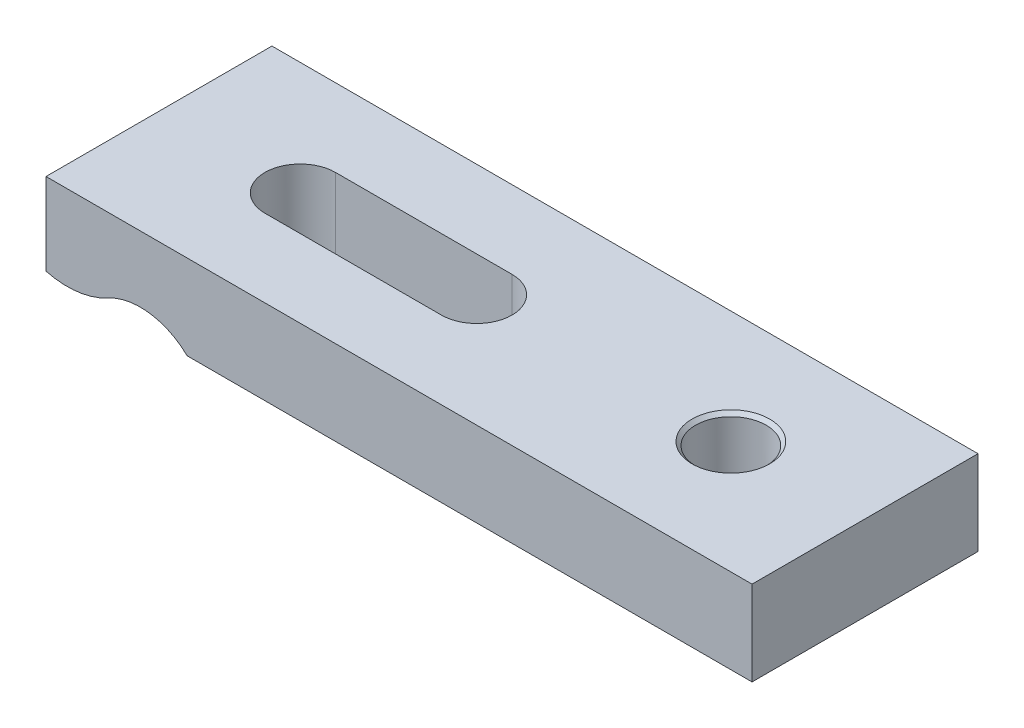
ISO-10303-21;
HEADER;
FILE_DESCRIPTION(('STEP AP214'),'2;1');
FILE_NAME('part.step','',(''),(''),'','','');
FILE_SCHEMA(('AUTOMOTIVE_DESIGN { 1 0 10303 214 1 1 1 1 }'));
ENDSEC;
DATA;
#1=APPLICATION_CONTEXT('core data for automotive mechanical design processes');
#2=APPLICATION_PROTOCOL_DEFINITION('international standard','automotive_design',2000,#1);
#3=PRODUCT_CONTEXT('',#1,'mechanical');
#4=PRODUCT('Part','Part','',(#3));
#5=PRODUCT_RELATED_PRODUCT_CATEGORY('part','',(#4));
#6=PRODUCT_DEFINITION_FORMATION('','',#4);
#7=PRODUCT_DEFINITION_CONTEXT('part definition',#1,'design');
#8=PRODUCT_DEFINITION('design','',#6,#7);
#9=PRODUCT_DEFINITION_SHAPE('','',#8);
#10=(LENGTH_UNIT() NAMED_UNIT(*) SI_UNIT(.MILLI.,.METRE.));
#11=(NAMED_UNIT(*) PLANE_ANGLE_UNIT() SI_UNIT($,.RADIAN.));
#12=(NAMED_UNIT(*) SI_UNIT($,.STERADIAN.) SOLID_ANGLE_UNIT());
#13=UNCERTAINTY_MEASURE_WITH_UNIT(LENGTH_MEASURE(1.E-05),#10,'distance_accuracy_value','');
#14=(GEOMETRIC_REPRESENTATION_CONTEXT(3) GLOBAL_UNCERTAINTY_ASSIGNED_CONTEXT((#13)) GLOBAL_UNIT_ASSIGNED_CONTEXT((#10,
#11,#12)) REPRESENTATION_CONTEXT('',''));
#15=CARTESIAN_POINT('',(0.,0.,0.));
#16=DIRECTION('',(0.,0.,1.));
#17=DIRECTION('',(1.,0.,0.));
#18=AXIS2_PLACEMENT_3D('',#15,#16,#17);
#19=CARTESIAN_POINT('',(0.,0.,32.));
#20=DIRECTION('',(1.,0.,0.));
#21=DIRECTION('',(0.,1.,0.));
#22=AXIS2_PLACEMENT_3D('',#19,#20,#21);
#23=PLANE('',#22);
#24=DIRECTION('',(0.,-1.,0.));
#25=VECTOR('',#24,1.);
#26=CARTESIAN_POINT('',(0.,0.,0.));
#27=LINE('',#26,#25);
#28=CARTESIAN_POINT('',(0.,0.,0.));
#29=VERTEX_POINT('',#28);
#30=CARTESIAN_POINT('',(0.,-11.6189500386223,0.));
#31=VERTEX_POINT('',#30);
#32=EDGE_CURVE('E161',#29,#31,#27,.T.);
#33=ORIENTED_EDGE('',*,*,#32,.T.);
#34=DIRECTION('',(0.,0.,-1.));
#35=VECTOR('',#34,1.);
#36=CARTESIAN_POINT('',(0.,-11.6189500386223,32.));
#37=LINE('',#36,#35);
#38=CARTESIAN_POINT('',(0.,-11.6189500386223,32.));
#39=VERTEX_POINT('',#38);
#40=EDGE_CURVE('E224',#39,#31,#37,.T.);
#41=ORIENTED_EDGE('',*,*,#40,.F.);
#42=DIRECTION('',(0.,-1.,0.));
#43=VECTOR('',#42,1.);
#44=CARTESIAN_POINT('',(0.,0.,32.));
#45=LINE('',#44,#43);
#46=CARTESIAN_POINT('',(0.,0.,32.));
#47=VERTEX_POINT('',#46);
#48=EDGE_CURVE('E162',#47,#39,#45,.T.);
#49=ORIENTED_EDGE('',*,*,#48,.F.);
#50=DIRECTION('',(0.,0.,-1.));
#51=VECTOR('',#50,1.);
#52=CARTESIAN_POINT('',(0.,0.,32.));
#53=LINE('',#52,#51);
#54=EDGE_CURVE('E240',#47,#29,#53,.T.);
#55=ORIENTED_EDGE('',*,*,#54,.T.);
#56=EDGE_LOOP('',(#33,#41,#49,#55));
#57=FACE_BOUND('',#56,.T.);
#58=ADVANCED_FACE('F30',(#57),#23,.F.);
#59=CARTESIAN_POINT('',(3.,0.,32.));
#60=DIRECTION('',(0.,0.,-1.));
#61=DIRECTION('',(-1.,0.,0.));
#62=AXIS2_PLACEMENT_3D('',#59,#60,#61);
#63=CYLINDRICAL_SURFACE('',#62,12.);
#64=CARTESIAN_POINT('',(3.,0.,0.));
#65=DIRECTION('',(0.,0.,1.));
#66=DIRECTION('',(1.,0.,0.));
#67=AXIS2_PLACEMENT_3D('',#64,#65,#66);
#68=CIRCLE('',#67,12.);
#69=CARTESIAN_POINT('',(8.7617013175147,-10.5262907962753,0.));
#70=VERTEX_POINT('',#69);
#71=EDGE_CURVE('E253',#31,#70,#68,.T.);
#72=ORIENTED_EDGE('',*,*,#71,.T.);
#73=DIRECTION('',(0.,0.,-1.));
#74=VECTOR('',#73,1.);
#75=CARTESIAN_POINT('',(8.7617013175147,-10.5262907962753,32.));
#76=LINE('',#75,#74);
#77=CARTESIAN_POINT('',(8.7617013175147,-10.5262907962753,32.));
#78=VERTEX_POINT('',#77);
#79=EDGE_CURVE('E229',#78,#70,#76,.T.);
#80=ORIENTED_EDGE('',*,*,#79,.F.);
#81=CARTESIAN_POINT('',(3.,0.,32.));
#82=DIRECTION('',(0.,0.,1.));
#83=DIRECTION('',(1.,0.,0.));
#84=AXIS2_PLACEMENT_3D('',#81,#82,#83);
#85=CIRCLE('',#84,12.);
#86=EDGE_CURVE('E262',#39,#78,#85,.T.);
#87=ORIENTED_EDGE('',*,*,#86,.F.);
#88=ORIENTED_EDGE('',*,*,#40,.T.);
#89=EDGE_LOOP('',(#72,#80,#87,#88));
#90=FACE_BOUND('',#89,.T.);
#91=ADVANCED_FACE('F194',(#90),#63,.T.);
#92=CARTESIAN_POINT('',(13.3710623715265,-18.9473234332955,32.));
#93=DIRECTION('',(0.,0.,-1.));
#94=DIRECTION('',(-1.,0.,0.));
#95=AXIS2_PLACEMENT_3D('',#92,#93,#94);
#96=CYLINDRICAL_SURFACE('',#95,9.6);
#97=DIRECTION('',(0.,0.,-1.));
#98=VECTOR('',#97,1.);
#99=CARTESIAN_POINT('',(19.9963696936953,-12.,32.));
#100=LINE('',#99,#98);
#101=CARTESIAN_POINT('',(19.9963696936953,-12.,11.0000013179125));
#102=VERTEX_POINT('',#101);
#103=CARTESIAN_POINT('',(19.9963696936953,-12.,0.));
#104=VERTEX_POINT('',#103);
#105=EDGE_CURVE('E233',#102,#104,#100,.T.);
#106=ORIENTED_EDGE('',*,*,#105,.F.);
#107=CARTESIAN_POINT('',(19.9963696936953,-12.,11.0000013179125));
#108=CARTESIAN_POINT('',(19.8813083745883,-11.8902365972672,11.0000797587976));
#109=CARTESIAN_POINT('',(19.7634393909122,-11.7833250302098,11.004143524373));
#110=CARTESIAN_POINT('',(19.5228037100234,-11.5756727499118,11.0213614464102));
#111=CARTESIAN_POINT('',(19.4000316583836,-11.4749391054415,11.0345258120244));
#112=CARTESIAN_POINT('',(19.1497850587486,-11.2797470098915,11.0711844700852));
#113=CARTESIAN_POINT('',(19.0222857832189,-11.1853320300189,11.0947432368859));
#114=CARTESIAN_POINT('',(18.7645717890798,-11.0040966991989,11.1532313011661));
#115=CARTESIAN_POINT('',(18.634358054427,-10.9172736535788,11.1881565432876));
#116=CARTESIAN_POINT('',(18.3716238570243,-10.7510600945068,11.2705722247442));
#117=CARTESIAN_POINT('',(18.2390933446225,-10.6717322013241,11.3181576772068));
#118=CARTESIAN_POINT('',(17.9744699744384,-10.5216616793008,11.4264170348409));
#119=CARTESIAN_POINT('',(17.8423771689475,-10.4509200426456,11.487092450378));
#120=CARTESIAN_POINT('',(17.5811148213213,-10.318486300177,11.6215873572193));
#121=CARTESIAN_POINT('',(17.4519360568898,-10.2567607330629,11.6953558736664));
#122=CARTESIAN_POINT('',(17.1980466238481,-10.1420071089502,11.856134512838));
#123=CARTESIAN_POINT('',(17.0733351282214,-10.0889774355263,11.9431421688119));
#124=CARTESIAN_POINT('',(16.8480314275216,-9.99840007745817,12.1164104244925));
#125=CARTESIAN_POINT('',(16.7465640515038,-9.95972245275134,12.2009498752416));
#126=CARTESIAN_POINT('',(16.5495654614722,-9.88817895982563,12.3789341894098));
#127=CARTESIAN_POINT('',(16.4540339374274,-9.8553127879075,12.4723785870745));
#128=CARTESIAN_POINT('',(16.2699197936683,-9.7949452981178,12.6676541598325));
#129=CARTESIAN_POINT('',(16.1813437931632,-9.76744905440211,12.7694931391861));
#130=CARTESIAN_POINT('',(16.0122104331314,-9.7173657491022,12.9807545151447));
#131=CARTESIAN_POINT('',(15.931653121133,-9.69477871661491,13.0901769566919));
#132=CARTESIAN_POINT('',(15.7825603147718,-9.6548325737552,13.3110934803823));
#133=CARTESIAN_POINT('',(15.7136643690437,-9.63729522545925,13.4223125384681));
#134=CARTESIAN_POINT('',(15.5846008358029,-9.60576768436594,13.6502325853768));
#135=CARTESIAN_POINT('',(15.5244361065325,-9.59177865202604,13.7669353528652));
#136=CARTESIAN_POINT('',(15.4134043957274,-9.56691429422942,14.0049131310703));
#137=CARTESIAN_POINT('',(15.362531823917,-9.55603709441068,14.126185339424));
#138=CARTESIAN_POINT('',(15.2704280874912,-9.53697681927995,14.3725920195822));
#139=CARTESIAN_POINT('',(15.2292005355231,-9.52879475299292,14.497727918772));
#140=CARTESIAN_POINT('',(15.1556918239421,-9.51458570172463,14.7545968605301));
#141=CARTESIAN_POINT('',(15.123699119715,-9.50862678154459,14.8864162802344));
#142=CARTESIAN_POINT('',(15.0705103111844,-9.49890513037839,15.1523414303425));
#143=CARTESIAN_POINT('',(15.0493180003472,-9.49514317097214,15.2864479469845));
#144=CARTESIAN_POINT('',(15.0179061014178,-9.48961965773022,15.5559843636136));
#145=CARTESIAN_POINT('',(15.007686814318,-9.48785815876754,15.6914142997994));
#146=CARTESIAN_POINT('',(14.9982979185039,-9.48623855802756,15.9626683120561));
#147=CARTESIAN_POINT('',(14.9991284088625,-9.4863804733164,16.0984923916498));
#148=CARTESIAN_POINT('',(15.011953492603,-9.48859622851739,16.3721685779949));
#149=CARTESIAN_POINT('',(15.024158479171,-9.49070647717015,16.5100105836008));
#150=CARTESIAN_POINT('',(15.0599331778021,-9.49703008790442,16.7841152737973));
#151=CARTESIAN_POINT('',(15.0834990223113,-9.50124273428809,16.9203784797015));
#152=CARTESIAN_POINT('',(15.1418193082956,-9.51200157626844,17.1904503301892));
#153=CARTESIAN_POINT('',(15.1765779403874,-9.51854864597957,17.3242580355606));
#154=CARTESIAN_POINT('',(15.2569836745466,-9.53430176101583,17.5883450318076));
#155=CARTESIAN_POINT('',(15.3026265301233,-9.54350676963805,17.7186256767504));
#156=CARTESIAN_POINT('',(15.4043334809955,-9.56497281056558,17.9745312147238));
#157=CARTESIAN_POINT('',(15.4603792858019,-9.57722849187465,18.1001638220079));
#158=CARTESIAN_POINT('',(15.5824229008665,-9.60527863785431,18.346026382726));
#159=CARTESIAN_POINT('',(15.6484167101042,-9.62107168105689,18.4662584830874));
#160=CARTESIAN_POINT('',(15.7897621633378,-9.65672594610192,18.700483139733));
#161=CARTESIAN_POINT('',(15.8651151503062,-9.67658775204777,18.8144747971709));
#162=CARTESIAN_POINT('',(16.0244150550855,-9.72091833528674,19.0353354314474));
#163=CARTESIAN_POINT('',(16.1083617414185,-9.74538698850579,19.1422046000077));
#164=CARTESIAN_POINT('',(16.2818469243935,-9.79880612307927,19.3455597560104));
#165=CARTESIAN_POINT('',(16.3712030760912,-9.82763507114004,19.442233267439));
#166=CARTESIAN_POINT('',(16.5562901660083,-9.89062005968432,19.6273953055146));
#167=CARTESIAN_POINT('',(16.6520209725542,-9.92477599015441,19.7158840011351));
#168=CARTESIAN_POINT('',(16.848699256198,-9.99874439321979,19.8840740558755));
#169=CARTESIAN_POINT('',(16.9496418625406,-10.0385516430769,19.9637834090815));
#170=CARTESIAN_POINT('',(17.1556744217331,-10.1241068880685,20.1141311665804));
#171=CARTESIAN_POINT('',(17.2607643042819,-10.1698547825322,20.1847697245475));
#172=CARTESIAN_POINT('',(17.4714399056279,-10.2663088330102,20.3152500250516));
#173=CARTESIAN_POINT('',(17.5769584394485,-10.3168764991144,20.3753029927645));
#174=CARTESIAN_POINT('',(17.7897433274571,-10.4238591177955,20.4865561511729));
#175=CARTESIAN_POINT('',(17.8970103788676,-10.4802764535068,20.5377527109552));
#176=CARTESIAN_POINT('',(18.1123937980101,-10.5989747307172,20.6314972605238));
#177=CARTESIAN_POINT('',(18.220511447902,-10.6612673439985,20.6740274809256));
#178=CARTESIAN_POINT('',(18.436343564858,-10.791417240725,20.7505882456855));
#179=CARTESIAN_POINT('',(18.5440581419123,-10.8592728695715,20.784621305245));
#180=CARTESIAN_POINT('',(18.7689641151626,-11.0073894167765,20.8476304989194));
#181=CARTESIAN_POINT('',(18.8860231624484,-11.088212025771,20.8757577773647));
#182=CARTESIAN_POINT('',(19.1176270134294,-11.2559350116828,20.9229455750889));
#183=CARTESIAN_POINT('',(19.2321709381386,-11.3428374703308,20.9420029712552));
#184=CARTESIAN_POINT('',(19.4574019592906,-11.5218897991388,20.9717642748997));
#185=CARTESIAN_POINT('',(19.5681029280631,-11.6140167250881,20.982502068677));
#186=CARTESIAN_POINT('',(19.7854219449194,-11.8033173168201,20.9965795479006));
#187=CARTESIAN_POINT('',(19.8920436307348,-11.900486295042,20.9999259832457));
#188=CARTESIAN_POINT('',(19.9963696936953,-12.,20.9999986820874));
#189=B_SPLINE_CURVE_WITH_KNOTS('',3,(#107,#108,#109,#110,#111,#112,#113,#114,#115,#116,#117,
#118,#119,#120,#121,#122,#123,#124,#125,#126,#127,#128,#129,#130,#131,#132,#133,#134,#135,#136,
#137,#138,#139,#140,#141,#142,#143,#144,#145,#146,#147,#148,#149,#150,#151,#152,#153,#154,#155,
#156,#157,#158,#159,#160,#161,#162,#163,#164,#165,#166,#167,#168,#169,#170,#171,#172,#173,#174,
#175,#176,#177,#178,#179,#180,#181,#182,#183,#184,#185,#186,#187,#188),.UNSPECIFIED.,.F.,.F.,(4,
2,2,2,2,2,2,2,2,2,2,2,2,2,2,2,2,2,2,2,2,2,2,2,2,2,2,2,2,2,2,2,2,2,2,2,2,2,2,2,4),(0.,
0.477056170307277,0.954648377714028,1.43524557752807,1.91567149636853,2.39980995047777,
2.88400429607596,3.36635332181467,3.84861258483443,4.26094157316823,4.67324900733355,
5.08594417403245,5.49864178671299,5.89419032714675,6.28986806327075,6.68530696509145,
7.08089374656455,7.48775461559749,7.8947582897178,8.30177312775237,8.70879161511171,
9.12349135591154,9.5380500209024,9.95276407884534,10.3673165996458,10.7811470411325,
11.1948114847,11.6085353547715,12.0222480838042,12.4260408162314,12.8298252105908,
13.23323884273,13.6366456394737,14.0307598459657,14.4250352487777,14.8201111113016,
15.2150698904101,15.6496187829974,16.0843171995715,16.5172356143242,16.9497585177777),.UNSPECIFIED.);
#190=CARTESIAN_POINT('',(19.9963696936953,-12.,20.9999986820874));
#191=VERTEX_POINT('',#190);
#192=EDGE_CURVE('E151',#102,#191,#189,.T.);
#193=ORIENTED_EDGE('',*,*,#192,.T.);
#194=CARTESIAN_POINT('',(19.9963696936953,-12.,32.));
#195=VERTEX_POINT('',#194);
#196=EDGE_CURVE('E134',#195,#191,#100,.T.);
#197=ORIENTED_EDGE('',*,*,#196,.F.);
#198=CARTESIAN_POINT('',(13.3710623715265,-18.9473234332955,32.));
#199=DIRECTION('',(0.,0.,-1.));
#200=DIRECTION('',(-1.,0.,0.));
#201=AXIS2_PLACEMENT_3D('',#198,#199,#200);
#202=CIRCLE('',#201,9.6);
#203=EDGE_CURVE('E261',#78,#195,#202,.T.);
#204=ORIENTED_EDGE('',*,*,#203,.F.);
#205=ORIENTED_EDGE('',*,*,#79,.T.);
#206=CARTESIAN_POINT('',(13.3710623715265,-18.9473234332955,0.));
#207=DIRECTION('',(0.,0.,-1.));
#208=DIRECTION('',(-1.,0.,0.));
#209=AXIS2_PLACEMENT_3D('',#206,#207,#208);
#210=CIRCLE('',#209,9.6);
#211=EDGE_CURVE('E250',#70,#104,#210,.T.);
#212=ORIENTED_EDGE('',*,*,#211,.T.);
#213=EDGE_LOOP('',(#106,#193,#197,#204,#205,#212));
#214=FACE_BOUND('',#213,.T.);
#215=ADVANCED_FACE('F164',(#214),#96,.F.);
#216=CARTESIAN_POINT('',(19.9963696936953,-12.,32.));
#217=DIRECTION('',(0.,1.,0.));
#218=DIRECTION('',(0.,0.,1.));
#219=AXIS2_PLACEMENT_3D('',#216,#217,#218);
#220=PLANE('',#219);
#221=CARTESIAN_POINT('',(81.,-12.,16.));
#222=DIRECTION('',(0.,1.,0.));
#223=DIRECTION('',(0.,0.,1.));
#224=AXIS2_PLACEMENT_3D('',#221,#222,#223);
#225=CIRCLE('',#224,5.50000000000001);
#226=CARTESIAN_POINT('',(81.,-12.,21.5));
#227=VERTEX_POINT('',#226);
#228=EDGE_CURVE('E11',#227,#227,#225,.T.);
#229=ORIENTED_EDGE('',*,*,#228,.T.);
#230=EDGE_LOOP('',(#229));
#231=FACE_BOUND('',#230,.T.);
#232=DIRECTION('',(-1.,0.,0.));
#233=VECTOR('',#232,1.);
#234=CARTESIAN_POINT('',(20.,-12.,11.));
#235=LINE('',#234,#233);
#236=CARTESIAN_POINT('',(45.,-12.,11.));
#237=VERTEX_POINT('',#236);
#238=CARTESIAN_POINT('',(20.,-12.,11.));
#239=VERTEX_POINT('',#238);
#240=EDGE_CURVE('E121',#237,#239,#235,.T.);
#241=ORIENTED_EDGE('',*,*,#240,.T.);
#242=CARTESIAN_POINT('',(20.,-12.,16.));
#243=DIRECTION('',(0.,1.,0.));
#244=DIRECTION('',(0.,0.,1.));
#245=AXIS2_PLACEMENT_3D('',#242,#243,#244);
#246=CIRCLE('',#245,5.);
#247=EDGE_CURVE('E127',#239,#102,#246,.T.);
#248=ORIENTED_EDGE('',*,*,#247,.T.);
#249=ORIENTED_EDGE('',*,*,#105,.T.);
#250=DIRECTION('',(1.,0.,0.));
#251=VECTOR('',#250,1.);
#252=CARTESIAN_POINT('',(19.9963696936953,-12.,0.));
#253=LINE('',#252,#251);
#254=CARTESIAN_POINT('',(100.,-12.,0.));
#255=VERTEX_POINT('',#254);
#256=EDGE_CURVE('E248',#104,#255,#253,.T.);
#257=ORIENTED_EDGE('',*,*,#256,.T.);
#258=DIRECTION('',(0.,0.,-1.));
#259=VECTOR('',#258,1.);
#260=CARTESIAN_POINT('',(100.,-12.,32.));
#261=LINE('',#260,#259);
#262=CARTESIAN_POINT('',(100.,-12.,32.));
#263=VERTEX_POINT('',#262);
#264=EDGE_CURVE('E234',#263,#255,#261,.T.);
#265=ORIENTED_EDGE('',*,*,#264,.F.);
#266=DIRECTION('',(1.,0.,0.));
#267=VECTOR('',#266,1.);
#268=CARTESIAN_POINT('',(19.9963696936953,-12.,32.));
#269=LINE('',#268,#267);
#270=EDGE_CURVE('E259',#195,#263,#269,.T.);
#271=ORIENTED_EDGE('',*,*,#270,.F.);
#272=ORIENTED_EDGE('',*,*,#196,.T.);
#273=CARTESIAN_POINT('',(20.,-12.,21.));
#274=VERTEX_POINT('',#273);
#275=EDGE_CURVE('E115',#191,#274,#246,.T.);
#276=ORIENTED_EDGE('',*,*,#275,.T.);
#277=DIRECTION('',(1.,0.,0.));
#278=VECTOR('',#277,1.);
#279=CARTESIAN_POINT('',(20.,-12.,21.));
#280=LINE('',#279,#278);
#281=CARTESIAN_POINT('',(45.,-12.,21.));
#282=VERTEX_POINT('',#281);
#283=EDGE_CURVE('E124',#274,#282,#280,.T.);
#284=ORIENTED_EDGE('',*,*,#283,.T.);
#285=CARTESIAN_POINT('',(45.,-12.,16.));
#286=DIRECTION('',(0.,1.,0.));
#287=DIRECTION('',(0.,0.,1.));
#288=AXIS2_PLACEMENT_3D('',#285,#286,#287);
#289=CIRCLE('',#288,5.);
#290=EDGE_CURVE('E45',#282,#237,#289,.T.);
#291=ORIENTED_EDGE('',*,*,#290,.T.);
#292=EDGE_LOOP('',(#241,#248,#249,#257,#265,#271,#272,#276,#284,#291));
#293=FACE_BOUND('',#292,.T.);
#294=ADVANCED_FACE('F131',(#231,#293),#220,.F.);
#295=CARTESIAN_POINT('',(100.,0.,32.));
#296=DIRECTION('',(-1.,0.,0.));
#297=DIRECTION('',(0.,0.,1.));
#298=AXIS2_PLACEMENT_3D('',#295,#296,#297);
#299=PLANE('',#298);
#300=DIRECTION('',(0.,1.,0.));
#301=VECTOR('',#300,1.);
#302=CARTESIAN_POINT('',(100.,0.,0.));
#303=LINE('',#302,#301);
#304=CARTESIAN_POINT('',(100.,0.,0.));
#305=VERTEX_POINT('',#304);
#306=EDGE_CURVE('E246',#255,#305,#303,.T.);
#307=ORIENTED_EDGE('',*,*,#306,.T.);
#308=DIRECTION('',(0.,0.,-1.));
#309=VECTOR('',#308,1.);
#310=CARTESIAN_POINT('',(100.,0.,32.));
#311=LINE('',#310,#309);
#312=CARTESIAN_POINT('',(100.,0.,32.));
#313=VERTEX_POINT('',#312);
#314=EDGE_CURVE('E237',#313,#305,#311,.T.);
#315=ORIENTED_EDGE('',*,*,#314,.F.);
#316=DIRECTION('',(0.,1.,0.));
#317=VECTOR('',#316,1.);
#318=CARTESIAN_POINT('',(100.,0.,32.));
#319=LINE('',#318,#317);
#320=EDGE_CURVE('E257',#263,#313,#319,.T.);
#321=ORIENTED_EDGE('',*,*,#320,.F.);
#322=ORIENTED_EDGE('',*,*,#264,.T.);
#323=EDGE_LOOP('',(#307,#315,#321,#322));
#324=FACE_BOUND('',#323,.T.);
#325=ADVANCED_FACE('F185',(#324),#299,.F.);
#326=CARTESIAN_POINT('',(0.,0.,32.));
#327=DIRECTION('',(0.,-1.,0.));
#328=DIRECTION('',(0.,0.,-1.));
#329=AXIS2_PLACEMENT_3D('',#326,#327,#328);
#330=PLANE('',#329);
#331=CARTESIAN_POINT('',(81.,0.,16.));
#332=DIRECTION('',(0.,-1.,0.));
#333=DIRECTION('',(0.,0.,-1.));
#334=AXIS2_PLACEMENT_3D('',#331,#332,#333);
#335=CIRCLE('',#334,5.50000000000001);
#336=CARTESIAN_POINT('',(81.,0.,10.5));
#337=VERTEX_POINT('',#336);
#338=EDGE_CURVE('E38',#337,#337,#335,.T.);
#339=ORIENTED_EDGE('',*,*,#338,.T.);
#340=EDGE_LOOP('',(#339));
#341=FACE_BOUND('',#340,.T.);
#342=DIRECTION('',(1.,0.,0.));
#343=VECTOR('',#342,1.);
#344=CARTESIAN_POINT('',(20.,0.,21.));
#345=LINE('',#344,#343);
#346=CARTESIAN_POINT('',(20.,0.,21.));
#347=VERTEX_POINT('',#346);
#348=CARTESIAN_POINT('',(45.,0.,21.));
#349=VERTEX_POINT('',#348);
#350=EDGE_CURVE('E145',#347,#349,#345,.T.);
#351=ORIENTED_EDGE('',*,*,#350,.F.);
#352=CARTESIAN_POINT('',(20.,0.,16.));
#353=DIRECTION('',(0.,1.,0.));
#354=DIRECTION('',(0.,0.,1.));
#355=AXIS2_PLACEMENT_3D('',#352,#353,#354);
#356=CIRCLE('',#355,5.);
#357=CARTESIAN_POINT('',(20.,0.,11.));
#358=VERTEX_POINT('',#357);
#359=EDGE_CURVE('E53',#358,#347,#356,.T.);
#360=ORIENTED_EDGE('',*,*,#359,.F.);
#361=DIRECTION('',(-1.,0.,0.));
#362=VECTOR('',#361,1.);
#363=CARTESIAN_POINT('',(20.,0.,11.));
#364=LINE('',#363,#362);
#365=CARTESIAN_POINT('',(45.,0.,11.));
#366=VERTEX_POINT('',#365);
#367=EDGE_CURVE('E135',#366,#358,#364,.T.);
#368=ORIENTED_EDGE('',*,*,#367,.F.);
#369=CARTESIAN_POINT('',(45.,0.,16.));
#370=DIRECTION('',(0.,1.,0.));
#371=DIRECTION('',(0.,0.,1.));
#372=AXIS2_PLACEMENT_3D('',#369,#370,#371);
#373=CIRCLE('',#372,5.);
#374=EDGE_CURVE('E139',#349,#366,#373,.T.);
#375=ORIENTED_EDGE('',*,*,#374,.F.);
#376=EDGE_LOOP('',(#351,#360,#368,#375));
#377=FACE_BOUND('',#376,.T.);
#378=DIRECTION('',(-1.,0.,0.));
#379=VECTOR('',#378,1.);
#380=CARTESIAN_POINT('',(0.,0.,0.));
#381=LINE('',#380,#379);
#382=EDGE_CURVE('E244',#305,#29,#381,.T.);
#383=ORIENTED_EDGE('',*,*,#382,.T.);
#384=ORIENTED_EDGE('',*,*,#54,.F.);
#385=DIRECTION('',(-1.,0.,0.));
#386=VECTOR('',#385,1.);
#387=CARTESIAN_POINT('',(0.,0.,32.));
#388=LINE('',#387,#386);
#389=EDGE_CURVE('E243',#313,#47,#388,.T.);
#390=ORIENTED_EDGE('',*,*,#389,.F.);
#391=ORIENTED_EDGE('',*,*,#314,.T.);
#392=EDGE_LOOP('',(#383,#384,#390,#391));
#393=FACE_BOUND('',#392,.T.);
#394=ADVANCED_FACE('F178',(#341,#377,#393),#330,.F.);
#395=CARTESIAN_POINT('',(3.,0.,32.));
#396=DIRECTION('',(0.,0.,1.));
#397=DIRECTION('',(1.,0.,0.));
#398=AXIS2_PLACEMENT_3D('',#395,#396,#397);
#399=PLANE('',#398);
#400=ORIENTED_EDGE('',*,*,#48,.T.);
#401=ORIENTED_EDGE('',*,*,#86,.T.);
#402=ORIENTED_EDGE('',*,*,#203,.T.);
#403=ORIENTED_EDGE('',*,*,#270,.T.);
#404=ORIENTED_EDGE('',*,*,#320,.T.);
#405=ORIENTED_EDGE('',*,*,#389,.T.);
#406=EDGE_LOOP('',(#400,#401,#402,#403,#404,#405));
#407=FACE_BOUND('',#406,.T.);
#408=ADVANCED_FACE('F175',(#407),#399,.T.);
#409=CARTESIAN_POINT('',(3.,0.,0.));
#410=DIRECTION('',(0.,0.,1.));
#411=DIRECTION('',(1.,0.,0.));
#412=AXIS2_PLACEMENT_3D('',#409,#410,#411);
#413=PLANE('',#412);
#414=ORIENTED_EDGE('',*,*,#32,.F.);
#415=ORIENTED_EDGE('',*,*,#382,.F.);
#416=ORIENTED_EDGE('',*,*,#306,.F.);
#417=ORIENTED_EDGE('',*,*,#256,.F.);
#418=ORIENTED_EDGE('',*,*,#211,.F.);
#419=ORIENTED_EDGE('',*,*,#71,.F.);
#420=EDGE_LOOP('',(#414,#415,#416,#417,#418,#419));
#421=FACE_BOUND('',#420,.T.);
#422=ADVANCED_FACE('F173',(#421),#413,.F.);
#423=CARTESIAN_POINT('',(20.,-12.,16.));
#424=DIRECTION('',(0.,1.,0.));
#425=DIRECTION('',(0.,0.,1.));
#426=AXIS2_PLACEMENT_3D('',#423,#424,#425);
#427=CYLINDRICAL_SURFACE('',#426,5.);
#428=ORIENTED_EDGE('',*,*,#247,.F.);
#429=DIRECTION('',(0.,1.,0.));
#430=VECTOR('',#429,1.);
#431=CARTESIAN_POINT('',(20.,-12.,11.));
#432=LINE('',#431,#430);
#433=EDGE_CURVE('E149',#239,#358,#432,.T.);
#434=ORIENTED_EDGE('',*,*,#433,.T.);
#435=ORIENTED_EDGE('',*,*,#359,.T.);
#436=DIRECTION('',(0.,1.,0.));
#437=VECTOR('',#436,1.);
#438=CARTESIAN_POINT('',(20.,-12.,21.));
#439=LINE('',#438,#437);
#440=EDGE_CURVE('E110',#274,#347,#439,.T.);
#441=ORIENTED_EDGE('',*,*,#440,.F.);
#442=ORIENTED_EDGE('',*,*,#275,.F.);
#443=ORIENTED_EDGE('',*,*,#192,.F.);
#444=EDGE_LOOP('',(#428,#434,#435,#441,#442,#443));
#445=FACE_BOUND('',#444,.T.);
#446=ADVANCED_FACE('F113',(#445),#427,.F.);
#447=CARTESIAN_POINT('',(20.,-12.,11.));
#448=DIRECTION('',(0.,0.,-1.));
#449=DIRECTION('',(-1.,0.,0.));
#450=AXIS2_PLACEMENT_3D('',#447,#448,#449);
#451=PLANE('',#450);
#452=ORIENTED_EDGE('',*,*,#367,.T.);
#453=ORIENTED_EDGE('',*,*,#433,.F.);
#454=ORIENTED_EDGE('',*,*,#240,.F.);
#455=DIRECTION('',(0.,1.,0.));
#456=VECTOR('',#455,1.);
#457=CARTESIAN_POINT('',(45.,-12.,11.));
#458=LINE('',#457,#456);
#459=EDGE_CURVE('E152',#237,#366,#458,.T.);
#460=ORIENTED_EDGE('',*,*,#459,.T.);
#461=EDGE_LOOP('',(#452,#453,#454,#460));
#462=FACE_BOUND('',#461,.T.);
#463=ADVANCED_FACE('F172',(#462),#451,.F.);
#464=CARTESIAN_POINT('',(45.,-12.,16.));
#465=DIRECTION('',(0.,1.,0.));
#466=DIRECTION('',(0.,0.,1.));
#467=AXIS2_PLACEMENT_3D('',#464,#465,#466);
#468=CYLINDRICAL_SURFACE('',#467,5.);
#469=ORIENTED_EDGE('',*,*,#374,.T.);
#470=ORIENTED_EDGE('',*,*,#459,.F.);
#471=ORIENTED_EDGE('',*,*,#290,.F.);
#472=DIRECTION('',(0.,1.,0.));
#473=VECTOR('',#472,1.);
#474=CARTESIAN_POINT('',(45.,-12.,21.));
#475=LINE('',#474,#473);
#476=EDGE_CURVE('E120',#282,#349,#475,.T.);
#477=ORIENTED_EDGE('',*,*,#476,.T.);
#478=EDGE_LOOP('',(#469,#470,#471,#477));
#479=FACE_BOUND('',#478,.T.);
#480=ADVANCED_FACE('F285',(#479),#468,.F.);
#481=CARTESIAN_POINT('',(20.,-12.,21.));
#482=DIRECTION('',(0.,0.,1.));
#483=DIRECTION('',(1.,0.,0.));
#484=AXIS2_PLACEMENT_3D('',#481,#482,#483);
#485=PLANE('',#484);
#486=ORIENTED_EDGE('',*,*,#350,.T.);
#487=ORIENTED_EDGE('',*,*,#476,.F.);
#488=ORIENTED_EDGE('',*,*,#283,.F.);
#489=ORIENTED_EDGE('',*,*,#440,.T.);
#490=EDGE_LOOP('',(#486,#487,#488,#489));
#491=FACE_BOUND('',#490,.T.);
#492=ADVANCED_FACE('F125',(#491),#485,.F.);
#493=CARTESIAN_POINT('',(81.,-12.,16.));
#494=DIRECTION('',(0.,1.,0.));
#495=DIRECTION('',(0.,0.,1.));
#496=AXIS2_PLACEMENT_3D('',#493,#494,#495);
#497=CYLINDRICAL_SURFACE('',#496,5.);
#498=CARTESIAN_POINT('',(81.,-0.500000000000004,16.));
#499=DIRECTION('',(0.,-1.,0.));
#500=DIRECTION('',(0.,0.,-1.));
#501=AXIS2_PLACEMENT_3D('',#498,#499,#500);
#502=CIRCLE('',#501,5.);
#503=CARTESIAN_POINT('',(81.,-0.500000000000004,11.));
#504=VERTEX_POINT('',#503);
#505=EDGE_CURVE('E220',#504,#504,#502,.F.);
#506=ORIENTED_EDGE('',*,*,#505,.T.);
#507=EDGE_LOOP('',(#506));
#508=FACE_BOUND('',#507,.T.);
#509=CARTESIAN_POINT('',(81.,-11.5,16.));
#510=DIRECTION('',(0.,1.,0.));
#511=DIRECTION('',(0.,0.,1.));
#512=AXIS2_PLACEMENT_3D('',#509,#510,#511);
#513=CIRCLE('',#512,5.);
#514=CARTESIAN_POINT('',(81.,-11.5,21.));
#515=VERTEX_POINT('',#514);
#516=EDGE_CURVE('E221',#515,#515,#513,.F.);
#517=ORIENTED_EDGE('',*,*,#516,.T.);
#518=EDGE_LOOP('',(#517));
#519=FACE_BOUND('',#518,.T.);
#520=ADVANCED_FACE('F206',(#508,#519),#497,.F.);
#521=CARTESIAN_POINT('',(81.,-0.500000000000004,16.));
#522=DIRECTION('',(0.,1.,0.));
#523=DIRECTION('',(0.,0.,1.));
#524=AXIS2_PLACEMENT_3D('',#521,#522,#523);
#525=CONICAL_SURFACE('',#524,5.,0.785398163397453);
#526=ORIENTED_EDGE('',*,*,#338,.F.);
#527=EDGE_LOOP('',(#526));
#528=FACE_BOUND('',#527,.T.);
#529=ORIENTED_EDGE('',*,*,#505,.F.);
#530=EDGE_LOOP('',(#529));
#531=FACE_BOUND('',#530,.T.);
#532=ADVANCED_FACE('F204',(#528,#531),#525,.F.);
#533=CARTESIAN_POINT('',(81.,-12.,16.));
#534=DIRECTION('',(0.,-1.,0.));
#535=DIRECTION('',(0.,0.,-1.));
#536=AXIS2_PLACEMENT_3D('',#533,#534,#535);
#537=CONICAL_SURFACE('',#536,5.50000000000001,0.785398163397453);
#538=ORIENTED_EDGE('',*,*,#516,.F.);
#539=EDGE_LOOP('',(#538));
#540=FACE_BOUND('',#539,.T.);
#541=ORIENTED_EDGE('',*,*,#228,.F.);
#542=EDGE_LOOP('',(#541));
#543=FACE_BOUND('',#542,.T.);
#544=ADVANCED_FACE('F32',(#540,#543),#537,.F.);
#545=CLOSED_SHELL('',(#58,#91,#215,#294,#325,#394,#408,#422,#446,#463,#480,#492,#520,#532,#544));
#546=MANIFOLD_SOLID_BREP('B2',#545);
#547=ADVANCED_BREP_SHAPE_REPRESENTATION('',(#18,#546),#14);
#548=SHAPE_DEFINITION_REPRESENTATION(#9,#547);
ENDSEC;
END-ISO-10303-21;
